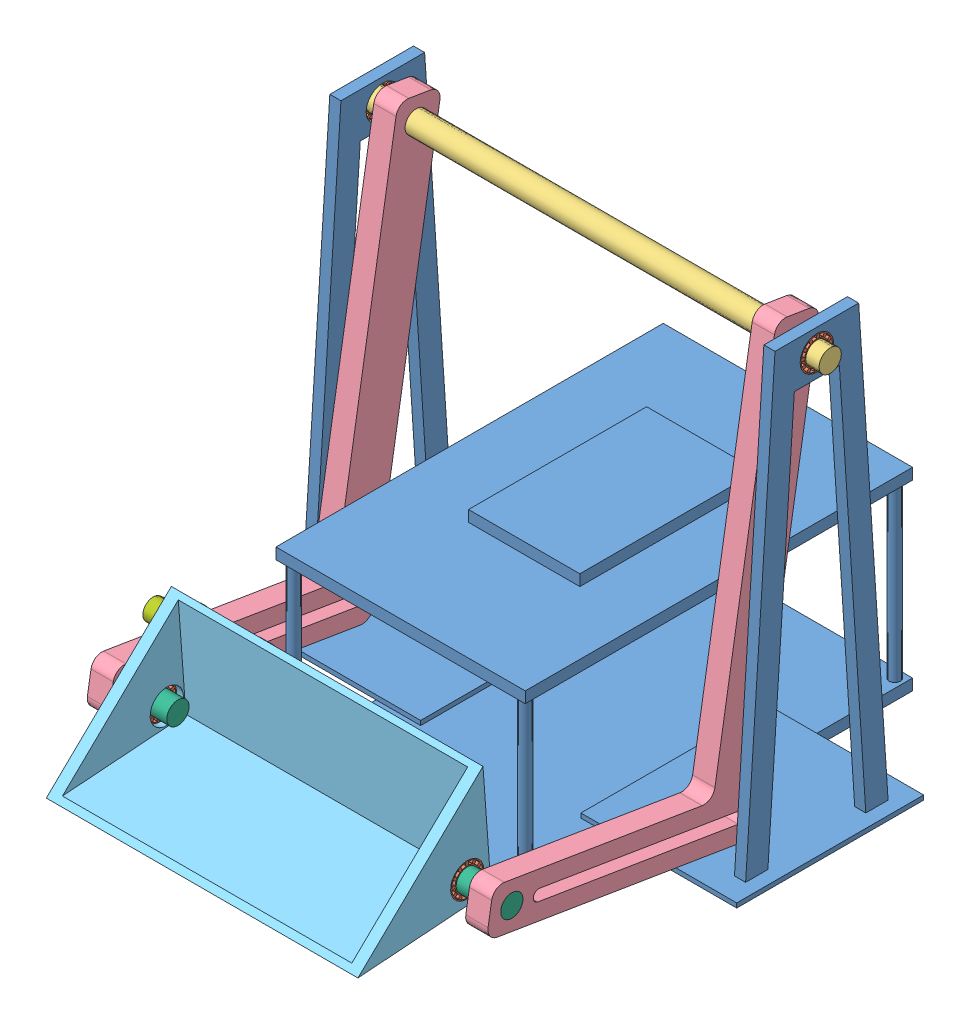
SolidWorks assembly New assembly for MAE Design-NC.SLDASM, configuration Default (file format 14000). Lengths in mm.
Overall size (269.24 285.36 338.88).
12 component instances, 7 part files, 26 mates.
Components (placement in the parent):
- rover base new-1: rover base new.SLDPRT [Default] at (65.1704 26.2361 121.8056) size (269.24 262.89 220.98)
- bearing-1: bearing.SLDPRT [Default] at (-59.2896 273.2511 232.2956) x (0 0 1) z (-1 0 0) size (19.05 19.05 2.54)
- bearing-2: bearing.SLDPRT [Default] at (189.6304 273.2511 232.2956) x (0 0.820707 -0.571349) z (1 0 0) size (19.05 19.05 2.54)
- long beam new-1: long beam new.SLDPRT [Default] at (-66.9096 273.2511 232.2956) x (0 -0.551536 0.834151) z (1 0 0) size (12.7 12.7 266.7)
- L arms-1: L arms.SLDPRT [Default] at (-49.1296 63.915 407.449) x (0 0.16203 0.986786) z (-1 0 0) size (152.4 247.65 12.7)
- L arms-2: L arms.SLDPRT [Default] at (166.7704 63.915 407.449) x (0 0.16203 0.986786) z (-1 0 0) size (152.4 247.65 12.7)
- bearing-3: bearing.SLDPRT [Default] at (-21.1896 74.5158 393.6286) x (0 0.588186 0.808726) z (-1 0 0) size (19.05 19.05 2.54)
- bearing-4: bearing.SLDPRT [Default] at (151.5304 74.5158 393.6286) x (0 0.872913 -0.487876) z (1 0 0) size (19.05 19.05 2.54)
- scoop with bearing slots-1: scoop with bearing slots.SLDPRT [Default] at (-23.7296 62.7812 380.0315) x (-1 0 0) z (0 0.073326 -0.997308) size (184.15 63.5 76.2)
- beam-1: beam.SLDPRT [Default] at (-11.0296 74.5158 393.6286) x (0 -0.99988 0.015512) z (-1 0 0) size (12.7 12.7 38.1)
- beam-2: beam.SLDPRT [Default] at (179.4704 74.5158 393.6286) x (0 -0.99988 0.015512) z (-1 0 0) size (12.7 12.7 38.1)
- slot piece for servo-1: slot piece for servo.SLDPRT [Default] at (-30.0796 98.2355 370.5408) x (0 -0.651753 -0.758432) z (1 0 0) size (88.08 11.88 40.64)
Mates (geometry in assembly coordinates):
- Concentric1: concentric anti-aligned: cylinder of rover base new-1 through (199.7904 273.2511 232.2956) axis (-1 0 0) radius 9.525; cylinder of bearing-1 through (-61.8296 273.2511 232.2956) axis (1 0 0) radius 9.525
- Coincident1: coincident aligned: plane of rover base new-1 through (-61.8296 26.2361 121.8056) normal (-1 0 0); plane of bearing-1 through (-61.8296 273.2511 232.2956) normal (-1 0 0)
- Concentric2: concentric anti-aligned: cylinder of rover base new-1 through (-69.4496 273.2511 232.2956) axis (1 0 0) radius 9.525; cylinder of bearing-2 through (192.1704 273.2511 232.2956) axis (-1 0 0) radius 9.525
- Coincident4: coincident aligned: plane of rover base new-1 through (192.1704 26.2361 121.8056) normal (1 0 0); plane of bearing-2 through (192.1704 273.2511 232.2956) normal (1 0 0)
- Concentric3: concentric anti-aligned: cylinder of bearing-1 through (-61.8296 273.2511 232.2956) axis (1 0 0) radius 6.35; cylinder of long beam new-1 through (199.7904 273.2511 232.2956) axis (-1 0 0) radius 6.35
- Distance1: distance = 5.08 mm aligned: plane of rover base new-1 through (-61.8296 26.2361 121.8056) normal (-1 0 0); plane of long beam new-1 through (-66.9096 273.2511 232.2956) normal (-1 0 0)
- Concentric4: concentric aligned: cylinder of long beam new-1 through (199.7904 273.2511 232.2956) axis (-1 0 0) radius 6.35; cylinder of L arms-1 through (-36.4296 273.2511 232.2956) axis (-1 0 0) radius 6.35
- Distance2: distance = 6.35 mm anti-aligned: plane of rover base new-1 through (-55.4796 26.2361 121.8056) normal (1 0 0); plane of L arms-1 through (-49.1296 63.915 407.449) normal (-1 0 0)
- Concentric5: concentric aligned: cylinder of long beam new-1 through (199.7904 273.2511 232.2956) axis (-1 0 0) radius 6.35; cylinder of L arms-2 through (179.4704 273.2511 232.2956) axis (-1 0 0) radius 6.35
- Distance3: distance = 6.35 mm anti-aligned: plane of rover base new-1 through (185.8204 26.2361 121.8056) normal (-1 0 0); plane of L arms-2 through (179.4704 63.915 407.449) normal (1 0 0)
- Concentric7: concentric anti-aligned: cylinder of L arms-1 through (-36.4296 74.5158 393.6286) axis (-1 0 0) radius 6.35; cylinder of long beam new-2 through (-71.0172 73.0526 385.4622) axis (1 0 0) radius 6.35
- Concentric8: concentric anti-aligned: cylinder of L arms-2 through (179.4704 74.5158 393.6286) axis (-1 0 0) radius 6.35; cylinder of long beam new-2 through (-71.0172 73.0526 385.4622) axis (1 0 0) radius 6.35
- Concentric9: concentric aligned: cylinder of bearing-4 through (154.0704 74.5158 393.6286) axis (-1 0 0) radius 9.525; cylinder of scoop with bearing slots-1 through (154.0704 74.5158 393.6286) axis (-1 0 0) radius 9.525
- Coincident5: coincident aligned: plane of bearing-4 through (154.0704 74.5158 393.6286) normal (1 0 0); plane of scoop with bearing slots-1 through (154.0704 62.7812 380.0315) normal (1 0 0)
- Concentric10: concentric anti-aligned: cylinder of bearing-3 through (-23.7296 74.5158 393.6286) axis (1 0 0) radius 9.525; cylinder of scoop with bearing slots-1 through (154.0704 74.5158 393.6286) axis (-1 0 0) radius 9.525
- Coincident6: coincident aligned: plane of bearing-3 through (-23.7296 74.5158 393.6286) normal (-1 0 0); plane of scoop with bearing slots-1 through (-23.7296 62.7812 380.0315) normal (-1 0 0)
- Concentric11: concentric anti-aligned: cylinder of L arms-1 through (-36.4296 74.5158 393.6286) axis (-1 0 0) radius 6.35; cylinder of beam-1 through (-49.1296 74.5158 393.6286) axis (1 0 0) radius 6.35
- Coincident7: coincident aligned: plane of L arms-1 through (-49.1296 63.915 407.449) normal (-1 0 0); plane of beam-1 through (-49.1296 74.5158 393.6286) normal (-1 0 0)
- Concentric13: concentric anti-aligned: cylinder of L arms-2 through (179.4704 74.5158 393.6286) axis (-1 0 0) radius 6.35; cylinder of beam-2 through (141.3704 74.5158 393.6286) axis (1 0 0) radius 6.35
- Coincident8: coincident aligned: plane of L arms-2 through (179.4704 63.915 407.449) normal (1 0 0); plane of beam-2 through (179.4704 74.5158 393.6286) normal (1 0 0)
- Concentric14: concentric aligned: cylinder of bearing-3 through (-23.7296 74.5158 393.6286) axis (1 0 0) radius 6.35; cylinder of beam-1 through (-49.1296 74.5158 393.6286) axis (1 0 0) radius 6.35
- Concentric15: concentric anti-aligned: cylinder of bearing-4 through (154.0704 74.5158 393.6286) axis (-1 0 0) radius 6.35; cylinder of beam-2 through (141.3704 74.5158 393.6286) axis (1 0 0) radius 6.35
- Distance4: distance = 12.7 mm anti-aligned: plane of scoop with bearing slots-1 through (-23.7296 62.7812 380.0315) normal (-1 0 0); plane of L arms-1 through (-36.4296 63.915 407.449) normal (1 0 0)
- Concentric16: concentric anti-aligned: cylinder of scoop with bearing slots-1 through (-30.0796 113.831 388.689) axis (1 0 0) radius 3.175; cylinder of slot piece for servo-1 through (-23.7296 113.831 388.689) axis (-1 0 0) radius 3.175
- Coincident9: coincident anti-aligned: plane of scoop with bearing slots-1 through (-23.7296 62.7812 380.0315) normal (-1 0 0); plane of slot piece for servo-1 through (-23.7296 113.831 388.689) normal (1 0 0)
- Tangent1: tangent anti-aligned: plane of L arms-1 through (-49.1296 68.8516 378.7283) normal (0 0.986786 -0.16203); cylinder of slot piece for servo-1 through (-61.8296 64.1674 330.8965) axis (1 0 0) radius 3.1279
